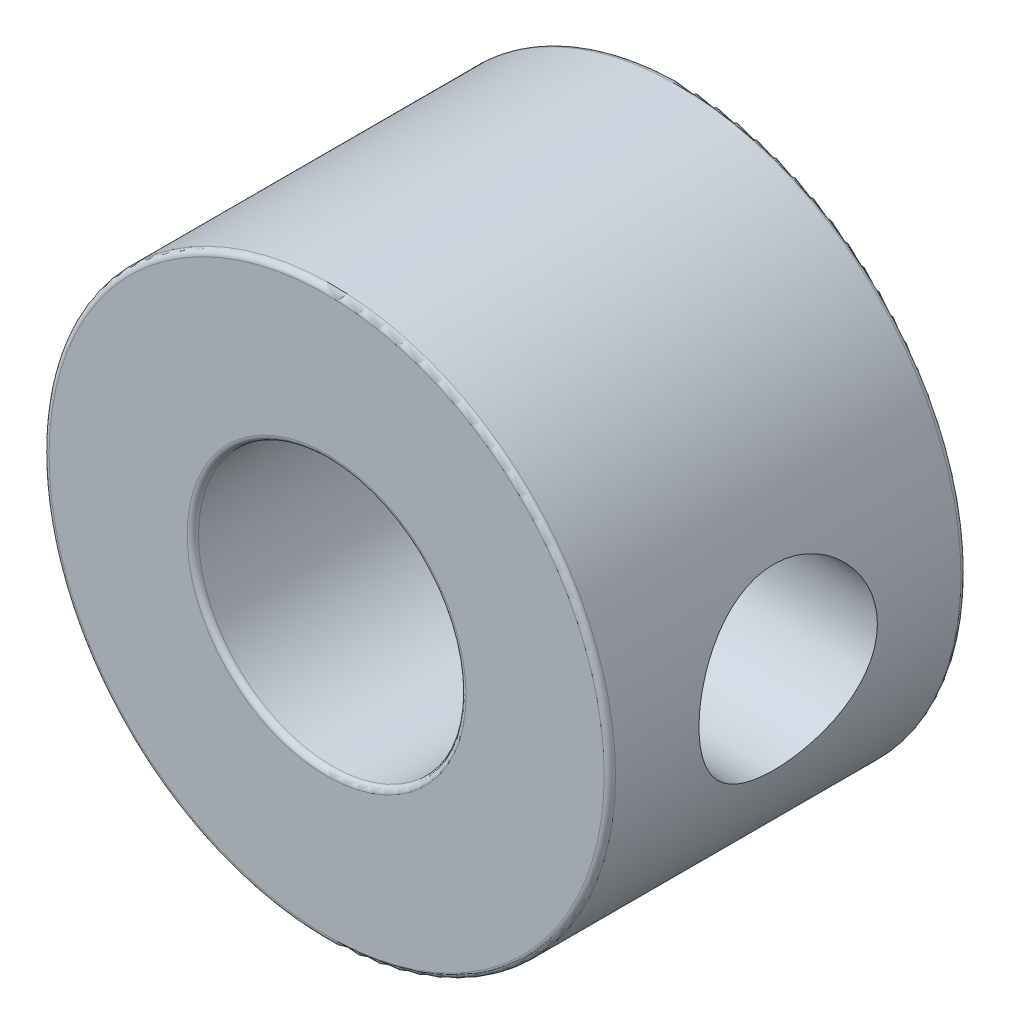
from build123d import *

# Parameters (mm, degrees)
SKETCH1_R               = 6.35
SKETCH1_R_2             = 3
EXTRUDE1_DEPTH          = 8
CUT_EXTRUDE1_REACH      = 18.298
CUT_EXTRUDE1_END_RADIUS = 3
SKETCH2_R               = 2
FILLET1_R               = 0.127


with BuildPart() as part:
    # Sketch1 → Extrude1 (new body)
    with BuildSketch(Plane.XY):
        Circle(SKETCH1_R)
        Circle(SKETCH1_R_2, mode=Mode.SUBTRACT)
    extrude(amount=EXTRUDE1_DEPTH)

    # Cut-Extrude1: up to this cylinder (the profile starts outside it)
    cut_extrude1_end = Plane(origin=(0, 0, 4), z_dir=(0, 0, -1)) * Cylinder(CUT_EXTRUDE1_END_RADIUS, 43.596, mode=Mode.PRIVATE)
    # Sketch2 → Cut-Extrude1 (cut, up to the surface)
    with BuildSketch(Plane(origin=(6.35, 0, 0), x_dir=(0, 0, -1), z_dir=(1, 0, 0)), mode=Mode.PRIVATE) as cut_extrude1_sk1:
        with Locations((-4, 0)):
            Circle(SKETCH2_R)
    cut_extrude1_tool1 = extrude(cut_extrude1_sk1.sketch, amount=-CUT_EXTRUDE1_REACH, mode=Mode.PRIVATE) - cut_extrude1_end
    add(cut_extrude1_tool1.solids().sort_by_distance((6.35, 0, 4))[0], mode=Mode.SUBTRACT)

    # Fillet1
    fillet1_edges = [part.edges().sort_by_distance(p)[0] for p in [
        (-6.35, 0, 0),
        (-6.35, 0, 8),
        (-3, 0, 0),
        (-3, 0, 8),
    ]]
    fillet(fillet1_edges, radius=FILLET1_R)


solid = part.part
